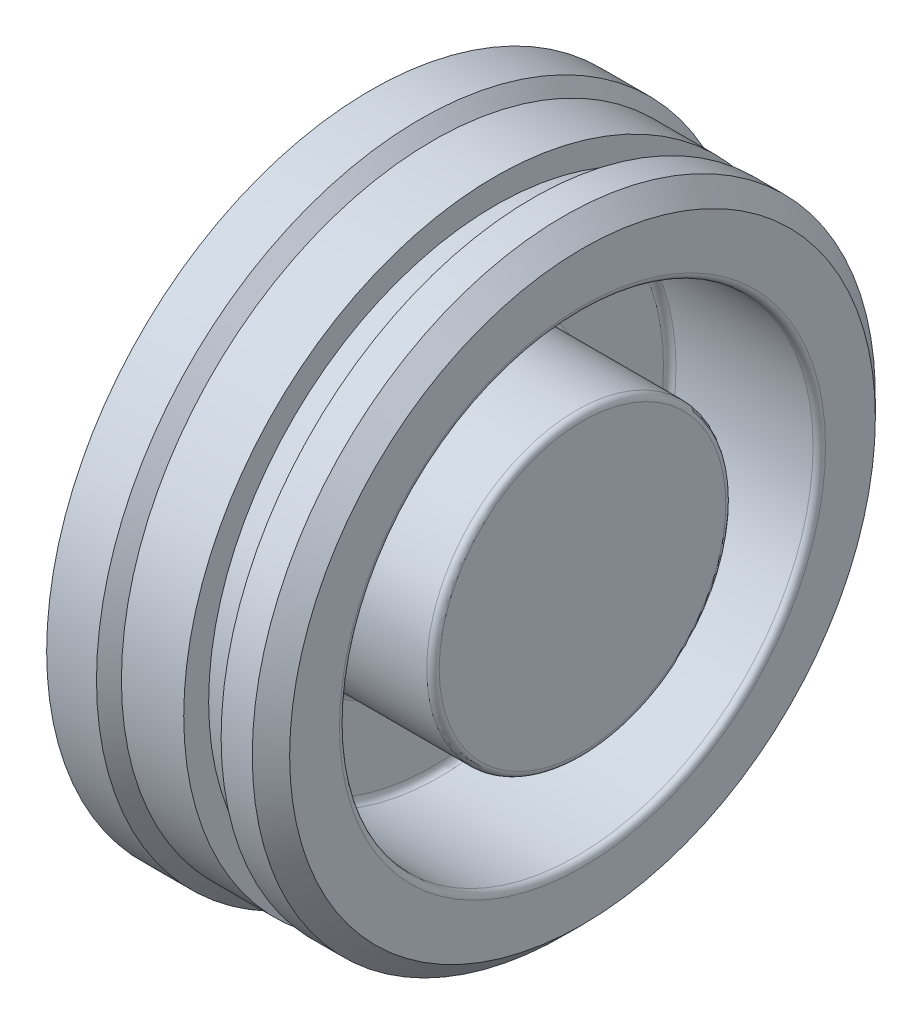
from build123d import *

# Parameters (mm, degrees)
CHANFREIN1_SIZE         = 0.75
ESQUISSE2_R             = 9.5
ESQUISSE2_R_2           = 6
ENL_V_MAT_EXTRU_1_DEPTH = 6
CONG_1_R                = 0.25


with BuildPart() as part:
    # Esquisse1 → R_volution1 (revolve)
    with BuildSketch(Plane.XY, mode=Mode.PRIVATE) as r_volution1_sk:
        Polygon((-51.5, 12.5), (-53.5, 12.5), (-53.5, 11.5), (-55, 11.5), (-55, 12.5), (-57.5, 12.5), (-58, 13), (-60, 13), (-60, 0), (-51.5, 0), align=None)
    revolve(r_volution1_sk.sketch.rotate(Axis((-72.747969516, 0, 0), (1, 0, 0)), 90), axis=Axis((-72.747969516, 0, 0), (1, 0, 0)))

    # Chanfrein1
    chanfrein1_edges = [part.edges().sort_by_distance(p)[0] for p in [
        (-51.5, 0, -12.5),
    ]]
    chamfer(chanfrein1_edges, length=CHANFREIN1_SIZE)

    # Esquisse2 → Enl_v. mat.-Extru.1 (cut)
    with BuildSketch(Plane(origin=(-51.5, 0, 0), x_dir=(0, 0, -1), z_dir=(1, 0, 0))):
        Circle(ESQUISSE2_R)
        Circle(ESQUISSE2_R_2, mode=Mode.SUBTRACT)
    extrude(amount=-ENL_V_MAT_EXTRU_1_DEPTH, mode=Mode.SUBTRACT)

    # Cong_1
    cong_1_edges = [part.edges().sort_by_distance(p)[0] for p in [
        (-51.5, 0, 9.5),
        (-57.5, 0, 9.5),
        (-57.5, 0, 6),
        (-51.5, 0, 6),
    ]]
    fillet(cong_1_edges, radius=CONG_1_R)


solid = part.part
